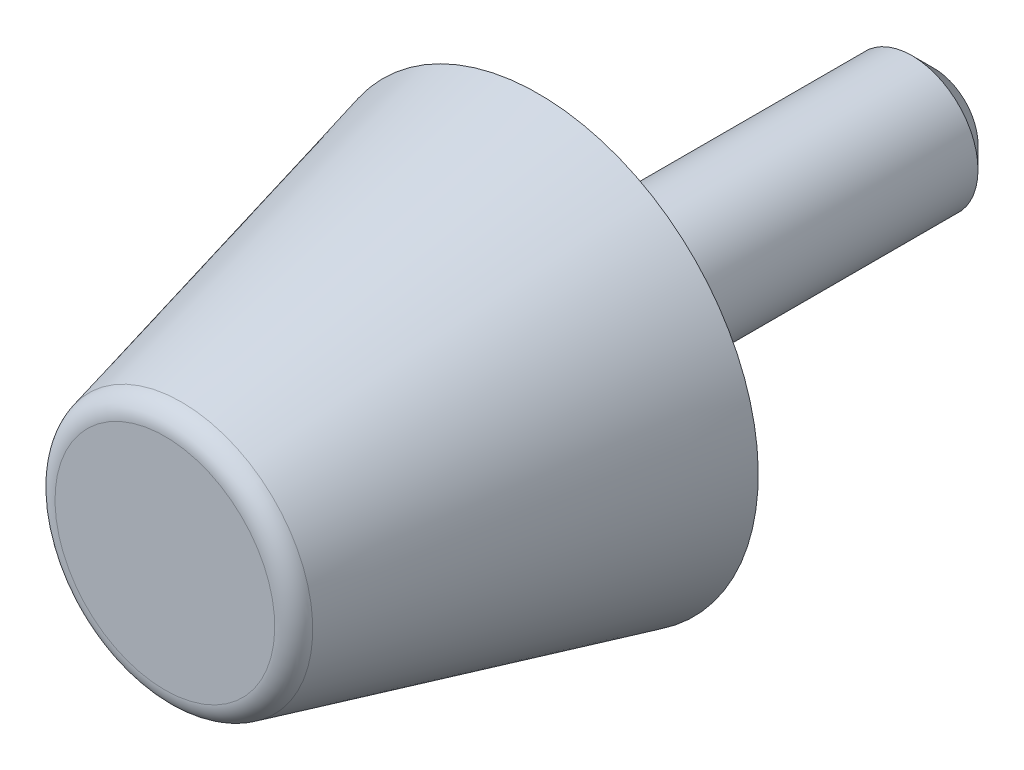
ISO-10303-21;
HEADER;
FILE_DESCRIPTION(('STEP AP214'),'2;1');
FILE_NAME('part.step','',(''),(''),'','','');
FILE_SCHEMA(('AUTOMOTIVE_DESIGN { 1 0 10303 214 1 1 1 1 }'));
ENDSEC;
DATA;
#1=APPLICATION_CONTEXT('core data for automotive mechanical design processes');
#2=APPLICATION_PROTOCOL_DEFINITION('international standard','automotive_design',2000,#1);
#3=PRODUCT_CONTEXT('',#1,'mechanical');
#4=PRODUCT('Part','Part','',(#3));
#5=PRODUCT_RELATED_PRODUCT_CATEGORY('part','',(#4));
#6=PRODUCT_DEFINITION_FORMATION('','',#4);
#7=PRODUCT_DEFINITION_CONTEXT('part definition',#1,'design');
#8=PRODUCT_DEFINITION('design','',#6,#7);
#9=PRODUCT_DEFINITION_SHAPE('','',#8);
#10=(LENGTH_UNIT() NAMED_UNIT(*) SI_UNIT(.MILLI.,.METRE.));
#11=(NAMED_UNIT(*) PLANE_ANGLE_UNIT() SI_UNIT($,.RADIAN.));
#12=(NAMED_UNIT(*) SI_UNIT($,.STERADIAN.) SOLID_ANGLE_UNIT());
#13=UNCERTAINTY_MEASURE_WITH_UNIT(LENGTH_MEASURE(1.E-05),#10,'distance_accuracy_value','');
#14=(GEOMETRIC_REPRESENTATION_CONTEXT(3) GLOBAL_UNCERTAINTY_ASSIGNED_CONTEXT((#13)) GLOBAL_UNIT_ASSIGNED_CONTEXT((#10,
#11,#12)) REPRESENTATION_CONTEXT('',''));
#15=CARTESIAN_POINT('',(0.,0.,0.));
#16=DIRECTION('',(0.,0.,1.));
#17=DIRECTION('',(1.,0.,0.));
#18=AXIS2_PLACEMENT_3D('',#15,#16,#17);
#19=CARTESIAN_POINT('',(0.,0.,17.));
#20=DIRECTION('',(0.,0.,1.));
#21=DIRECTION('',(0.,-1.,0.));
#22=AXIS2_PLACEMENT_3D('',#19,#20,#21);
#23=CYLINDRICAL_SURFACE('',#22,9.);
#24=CARTESIAN_POINT('',(0.,0.,0.));
#25=DIRECTION('',(0.,0.,1.));
#26=DIRECTION('',(0.,-1.,0.));
#27=AXIS2_PLACEMENT_3D('',#24,#25,#26);
#28=CIRCLE('',#27,9.);
#29=CARTESIAN_POINT('',(0.,-9.,0.));
#30=VERTEX_POINT('',#29);
#31=EDGE_CURVE('E27',#30,#30,#28,.T.);
#32=ORIENTED_EDGE('',*,*,#31,.F.);
#33=EDGE_LOOP('',(#32));
#34=FACE_BOUND('',#33,.T.);
#35=CARTESIAN_POINT('',(0.,0.,0.0500000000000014));
#36=DIRECTION('',(0.,0.,1.));
#37=DIRECTION('',(0.,-1.,0.));
#38=AXIS2_PLACEMENT_3D('',#35,#36,#37);
#39=CIRCLE('',#38,9.);
#40=CARTESIAN_POINT('',(0.,-9.,0.0500000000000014));
#41=VERTEX_POINT('',#40);
#42=EDGE_CURVE('E44',#41,#41,#39,.T.);
#43=ORIENTED_EDGE('',*,*,#42,.T.);
#44=EDGE_LOOP('',(#43));
#45=FACE_BOUND('',#44,.T.);
#46=ADVANCED_FACE('F12',(#34,#45),#23,.F.);
#47=CARTESIAN_POINT('',(9.,0.,0.));
#48=DIRECTION('',(0.,0.,1.));
#49=DIRECTION('',(0.,-1.,0.));
#50=AXIS2_PLACEMENT_3D('',#47,#48,#49);
#51=PLANE('',#50);
#52=CARTESIAN_POINT('',(0.,0.,0.));
#53=DIRECTION('',(0.,0.,1.));
#54=DIRECTION('',(0.,-1.,0.));
#55=AXIS2_PLACEMENT_3D('',#52,#53,#54);
#56=CIRCLE('',#55,10.);
#57=CARTESIAN_POINT('',(0.,-10.,0.));
#58=VERTEX_POINT('',#57);
#59=EDGE_CURVE('E32',#58,#58,#56,.T.);
#60=ORIENTED_EDGE('',*,*,#59,.F.);
#61=EDGE_LOOP('',(#60));
#62=FACE_BOUND('',#61,.T.);
#63=ORIENTED_EDGE('',*,*,#31,.T.);
#64=EDGE_LOOP('',(#63));
#65=FACE_BOUND('',#64,.T.);
#66=ADVANCED_FACE('F72',(#62,#65),#51,.F.);
#67=CARTESIAN_POINT('',(0.,0.,0.));
#68=DIRECTION('',(0.,0.,-1.));
#69=DIRECTION('',(0.,1.,0.));
#70=AXIS2_PLACEMENT_3D('',#67,#68,#69);
#71=CONICAL_SURFACE('',#70,10.,0.243194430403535);
#72=CARTESIAN_POINT('',(0.,0.,16.2408042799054));
#73=DIRECTION('',(0.,0.,1.));
#74=DIRECTION('',(0.,-1.,0.));
#75=AXIS2_PLACEMENT_3D('',#72,#73,#74);
#76=CIRCLE('',#75,5.97057369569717);
#77=CARTESIAN_POINT('',(0.,-5.97057369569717,16.2408042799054));
#78=VERTEX_POINT('',#77);
#79=EDGE_CURVE('E35',#78,#78,#76,.T.);
#80=ORIENTED_EDGE('',*,*,#79,.F.);
#81=EDGE_LOOP('',(#80));
#82=FACE_BOUND('',#81,.T.);
#83=ORIENTED_EDGE('',*,*,#59,.T.);
#84=EDGE_LOOP('',(#83));
#85=FACE_BOUND('',#84,.T.);
#86=ADVANCED_FACE('F77',(#82,#85),#71,.T.);
#87=CARTESIAN_POINT('',(0.,0.,16.));
#88=DIRECTION('',(0.,0.,1.));
#89=DIRECTION('',(0.,-1.,0.));
#90=AXIS2_PLACEMENT_3D('',#87,#88,#89);
#91=TOROIDAL_SURFACE('',#90,5.,1.);
#92=ORIENTED_EDGE('',*,*,#79,.T.);
#93=EDGE_LOOP('',(#92));
#94=FACE_BOUND('',#93,.T.);
#95=CARTESIAN_POINT('',(0.,0.,17.));
#96=DIRECTION('',(0.,0.,1.));
#97=DIRECTION('',(0.,-1.,0.));
#98=AXIS2_PLACEMENT_3D('',#95,#96,#97);
#99=CIRCLE('',#98,5.);
#100=CARTESIAN_POINT('',(0.,-5.,17.));
#101=VERTEX_POINT('',#100);
#102=EDGE_CURVE('E38',#101,#101,#99,.T.);
#103=ORIENTED_EDGE('',*,*,#102,.F.);
#104=EDGE_LOOP('',(#103));
#105=FACE_BOUND('',#104,.T.);
#106=ADVANCED_FACE('F84',(#94,#105),#91,.T.);
#107=CARTESIAN_POINT('',(5.,0.,17.));
#108=DIRECTION('',(0.,0.,-1.));
#109=DIRECTION('',(0.,1.,0.));
#110=AXIS2_PLACEMENT_3D('',#107,#108,#109);
#111=PLANE('',#110);
#112=ORIENTED_EDGE('',*,*,#102,.T.);
#113=EDGE_LOOP('',(#112));
#114=FACE_BOUND('',#113,.T.);
#115=ADVANCED_FACE('F59',(#114),#111,.F.);
#116=CARTESIAN_POINT('',(0.,0.,0.));
#117=DIRECTION('',(0.,0.,1.));
#118=DIRECTION('',(0.,-1.,0.));
#119=AXIS2_PLACEMENT_3D('',#116,#117,#118);
#120=PLANE('',#119);
#121=CARTESIAN_POINT('',(0.,0.,0.));
#122=DIRECTION('',(0.,0.,1.));
#123=DIRECTION('',(0.,-1.,0.));
#124=AXIS2_PLACEMENT_3D('',#121,#122,#123);
#125=CIRCLE('',#124,8.95);
#126=CARTESIAN_POINT('',(0.,-8.95,0.));
#127=VERTEX_POINT('',#126);
#128=EDGE_CURVE('E41',#127,#127,#125,.T.);
#129=ORIENTED_EDGE('',*,*,#128,.F.);
#130=EDGE_LOOP('',(#129));
#131=FACE_BOUND('',#130,.T.);
#132=CARTESIAN_POINT('',(0.,0.,0.));
#133=DIRECTION('',(0.,0.,1.));
#134=DIRECTION('',(0.,-1.,0.));
#135=AXIS2_PLACEMENT_3D('',#132,#133,#134);
#136=CIRCLE('',#135,3.);
#137=CARTESIAN_POINT('',(0.,-3.,0.));
#138=VERTEX_POINT('',#137);
#139=EDGE_CURVE('E23',#138,#138,#136,.T.);
#140=ORIENTED_EDGE('',*,*,#139,.T.);
#141=EDGE_LOOP('',(#140));
#142=FACE_BOUND('',#141,.T.);
#143=ADVANCED_FACE('F53',(#131,#142),#120,.F.);
#144=CARTESIAN_POINT('',(0.,0.,0.));
#145=DIRECTION('',(0.,0.,1.));
#146=DIRECTION('',(0.,-1.,0.));
#147=AXIS2_PLACEMENT_3D('',#144,#145,#146);
#148=CONICAL_SURFACE('',#147,8.95,0.785398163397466);
#149=ORIENTED_EDGE('',*,*,#42,.F.);
#150=EDGE_LOOP('',(#149));
#151=FACE_BOUND('',#150,.T.);
#152=ORIENTED_EDGE('',*,*,#128,.T.);
#153=EDGE_LOOP('',(#152));
#154=FACE_BOUND('',#153,.T.);
#155=ADVANCED_FACE('F49',(#151,#154),#148,.T.);
#156=CARTESIAN_POINT('',(0.,0.,17.));
#157=DIRECTION('',(0.,0.,1.));
#158=DIRECTION('',(0.,-1.,0.));
#159=AXIS2_PLACEMENT_3D('',#156,#157,#158);
#160=CYLINDRICAL_SURFACE('',#159,3.);
#161=CARTESIAN_POINT('',(0.,0.,-17.));
#162=DIRECTION('',(0.,0.,-1.));
#163=DIRECTION('',(0.,1.,0.));
#164=AXIS2_PLACEMENT_3D('',#161,#162,#163);
#165=CIRCLE('',#164,3.);
#166=CARTESIAN_POINT('',(0.,3.,-17.));
#167=VERTEX_POINT('',#166);
#168=EDGE_CURVE('E8',#167,#167,#165,.F.);
#169=ORIENTED_EDGE('',*,*,#168,.T.);
#170=EDGE_LOOP('',(#169));
#171=FACE_BOUND('',#170,.T.);
#172=ORIENTED_EDGE('',*,*,#139,.F.);
#173=EDGE_LOOP('',(#172));
#174=FACE_BOUND('',#173,.T.);
#175=ADVANCED_FACE('F52',(#171,#174),#160,.T.);
#176=CARTESIAN_POINT('',(0.,0.,-18.));
#177=DIRECTION('',(0.,0.,-1.));
#178=DIRECTION('',(0.,1.,0.));
#179=AXIS2_PLACEMENT_3D('',#176,#177,#178);
#180=PLANE('',#179);
#181=CARTESIAN_POINT('',(0.,0.,-18.));
#182=DIRECTION('',(0.,0.,-1.));
#183=DIRECTION('',(0.,1.,0.));
#184=AXIS2_PLACEMENT_3D('',#181,#182,#183);
#185=CIRCLE('',#184,2.);
#186=CARTESIAN_POINT('',(0.,2.,-18.));
#187=VERTEX_POINT('',#186);
#188=EDGE_CURVE('E19',#187,#187,#185,.T.);
#189=ORIENTED_EDGE('',*,*,#188,.T.);
#190=EDGE_LOOP('',(#189));
#191=FACE_BOUND('',#190,.T.);
#192=ADVANCED_FACE('F64',(#191),#180,.T.);
#193=CARTESIAN_POINT('',(0.,0.,-18.));
#194=DIRECTION('',(0.,0.,1.));
#195=DIRECTION('',(0.,-1.,0.));
#196=AXIS2_PLACEMENT_3D('',#193,#194,#195);
#197=CONICAL_SURFACE('',#196,2.,0.785398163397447);
#198=ORIENTED_EDGE('',*,*,#168,.F.);
#199=EDGE_LOOP('',(#198));
#200=FACE_BOUND('',#199,.T.);
#201=ORIENTED_EDGE('',*,*,#188,.F.);
#202=EDGE_LOOP('',(#201));
#203=FACE_BOUND('',#202,.T.);
#204=ADVANCED_FACE('F14',(#200,#203),#197,.T.);
#205=CLOSED_SHELL('',(#46,#66,#86,#106,#115,#143,#155,#175,#192,#204));
#206=MANIFOLD_SOLID_BREP('B1',#205);
#207=ADVANCED_BREP_SHAPE_REPRESENTATION('',(#18,#206),#14);
#208=SHAPE_DEFINITION_REPRESENTATION(#9,#207);
ENDSEC;
END-ISO-10303-21;
